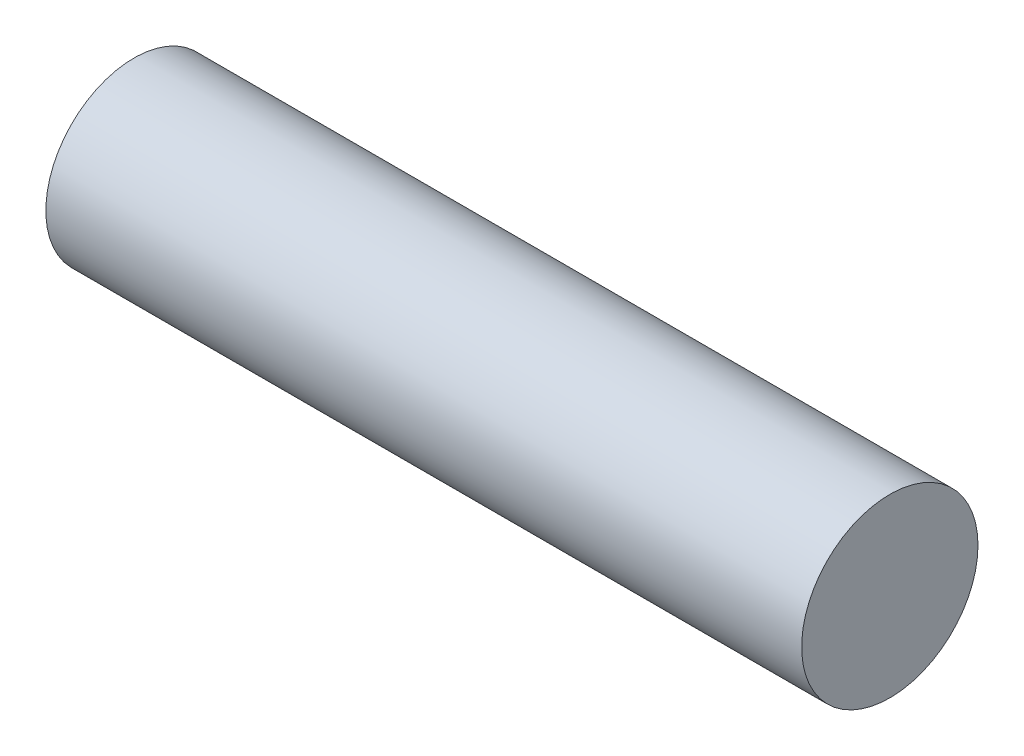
from build123d import *

# Parameters (mm, degrees)
SKETCH1_R           = 17.5
BOSS_EXTRUDE1_DEPTH = 150


with BuildPart() as part:
    # Sketch1 → Boss-Extrude1 (new body)
    with BuildSketch(Plane(origin=(0, 0, 0), x_dir=(0, 0, -1), z_dir=(1, 0, 0))):
        Circle(SKETCH1_R)
    extrude(amount=BOSS_EXTRUDE1_DEPTH)


solid = part.part
